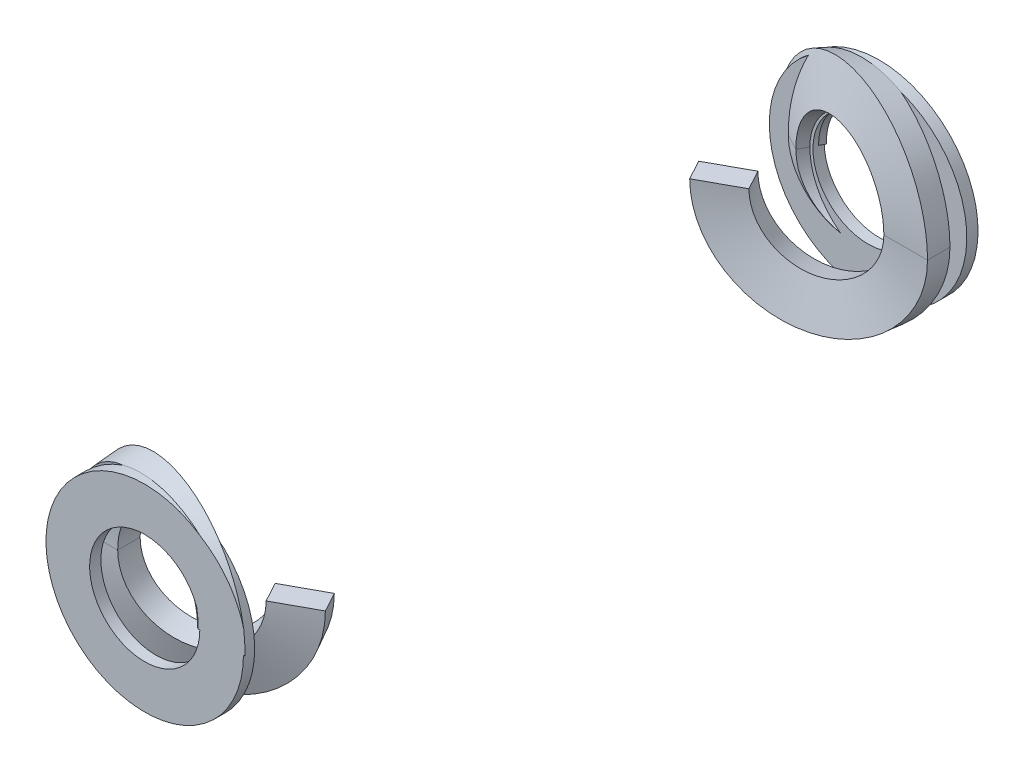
from build123d import *
from build123d.topology import SkipClean

# Parameters (mm, degrees)
SKETCH4_W               = 4.0005
SKETCH4_H               = 2.0574
SKETCH5_W               = 4.0005
SKETCH5_H               = 2.0574
REVOLVE3_ANGLE          = 180
SKETCH6_W               = 4.0005
SKETCH6_H               = 2.0574
REVOLVE4_ANGLE          = 180
REVOLVE8_ANGLE          = 90
SKETCH8_W               = 4.0005
SKETCH8_H               = 2.0574
REVOLVE6_ANGLE          = 180
SKETCH10_W              = 4.0005
SKETCH10_H              = 2.0574
REVOLVE7_ANGLE          = 180
REVOLVE9_ANGLE          = 90
CUT_EXTRUDE1_DEPTH      = 71.433066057
CUT_EXTRUDE1_DEPTH_BACK = 71.433066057
SKETCH9_W               = 19.05
SKETCH9_H               = 14.4018
SKETCH9_H_2             = 7.2009


with BuildPart() as part:
    # Sketch4 → Revolve2 (revolve)
    with BuildSketch(Plane(origin=(0, 0, 0), x_dir=(1, 0, 0), z_dir=(0, 1, 0)), mode=Mode.PRIVATE) as revolve2_sk:
        with Locations((-7.0485, 67.31)):
            Rectangle(SKETCH4_W, SKETCH4_H)
        with Locations((7.0485, 0)):
            Rectangle(SKETCH4_W, SKETCH4_H)
    revolve(revolve2_sk.sketch.rotate(Axis((0, 0, 0), (0, 0, -1)), 180), axis=Axis((0, 0, 0), (0, 0, -1)))



with BuildPart() as body_2:
    # Sketch5 → Revolve3 (revolve)
    with BuildSketch(Plane.XZ):
        with Locations((-7.0485, -3.60045)):
            Rectangle(SKETCH5_W, SKETCH5_H)
    revolve(axis=Axis((0, 0, -1.800225), (0.24746170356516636, 0, -0.9688976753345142)), revolution_arc=REVOLVE3_ANGLE)

    # Sketch6 → Revolve4 (revolve)
    with BuildSketch(Plane(origin=(0, 0, 0), x_dir=(1, 0, 0), z_dir=(0, 1, 0))):
        with Locations((-7.0485, 3.60045)):
            Rectangle(SKETCH6_W, SKETCH6_H)
    revolve(axis=Axis((0, 0, -5.400675), (0.24746170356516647, 0, 0.9688976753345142)), revolution_arc=REVOLVE4_ANGLE)


with BuildPart() as part_1:
    add(part.part)

    add(body_2.part)  # Revolve8 merges body 2
    # Sketch11 → Revolve8 (revolve)
    with BuildSketch(Plane(origin=(0, 0, 0), x_dir=(1, 0, 0), z_dir=(0, 1, 0))):
        Polygon((6.785764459, -1.0287), (8.310477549, -1.86189055), (8.76578058, -1.0287), align=None)
    revolve(axis=Axis((0, 0, 0), (-0.24746170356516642, 0, -0.9688976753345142)), revolution_arc=REVOLVE8_ANGLE)



with BuildPart() as body_2_2:
    # Sketch8 → Revolve6 (revolve)
    with BuildSketch(Plane(origin=(0, 0, 0), x_dir=(1, 0, 0), z_dir=(0, 1, 0))):
        with Locations((7.0485, 63.70955)):
            Rectangle(SKETCH8_W, SKETCH8_H)
    revolve(axis=Axis((0, 0, -65.509775), (-0.2474617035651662, 0, 0.9688976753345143)), revolution_arc=REVOLVE6_ANGLE)

    # Sketch10 → Revolve7 (revolve)
    with BuildSketch(Plane(origin=(0, 0, 0), x_dir=(1, 0, 0), z_dir=(0, 1, 0))):
        with Locations((7.0485, 63.70955)):
            Rectangle(SKETCH10_W, SKETCH10_H)
    revolve(axis=Axis((0, 0, -61.909325), (-0.2474617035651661, 0, -0.9688976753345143)), revolution_arc=REVOLVE7_ANGLE)


with BuildPart() as part_2:
    add(part_1.part)

    add(body_2_2.part)  # Revolve9 merges body 2 2
    # Sketch13 → Revolve9 (revolve)
    with BuildSketch(Plane(origin=(0, 0, 0), x_dir=(1, 0, 0), z_dir=(0, 1, 0))):
        Polygon((-5.33121942, 66.2813), (-5.786522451, 65.44810945), (-7.311235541, 66.2813), align=None)
    revolve(axis=Axis((0, 0, -67.31), (0.24746170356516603, 0, 0.9688976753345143)), revolution_arc=REVOLVE9_ANGLE)

    # Sketch9 → Cut-Extrude1 (cut, two sides: drawn at the far end of the back side and taken through both)
    with SkipClean():  # the faces are left unmerged after this step: merging them gives an invalid solid
        with BuildSketch(Plane(origin=(0, 0, 0), x_dir=(1, 0, 0), z_dir=(0, 1, 0)).offset(-CUT_EXTRUDE1_DEPTH_BACK)):
            with Locations((0, -7.2009)):
                Rectangle(SKETCH9_W, SKETCH9_H)
            with Locations((0, 70.91045)):
                Rectangle(SKETCH9_W, SKETCH9_H_2)
        extrude(amount=CUT_EXTRUDE1_DEPTH + CUT_EXTRUDE1_DEPTH_BACK, mode=Mode.SUBTRACT)


solid = part_2.part
